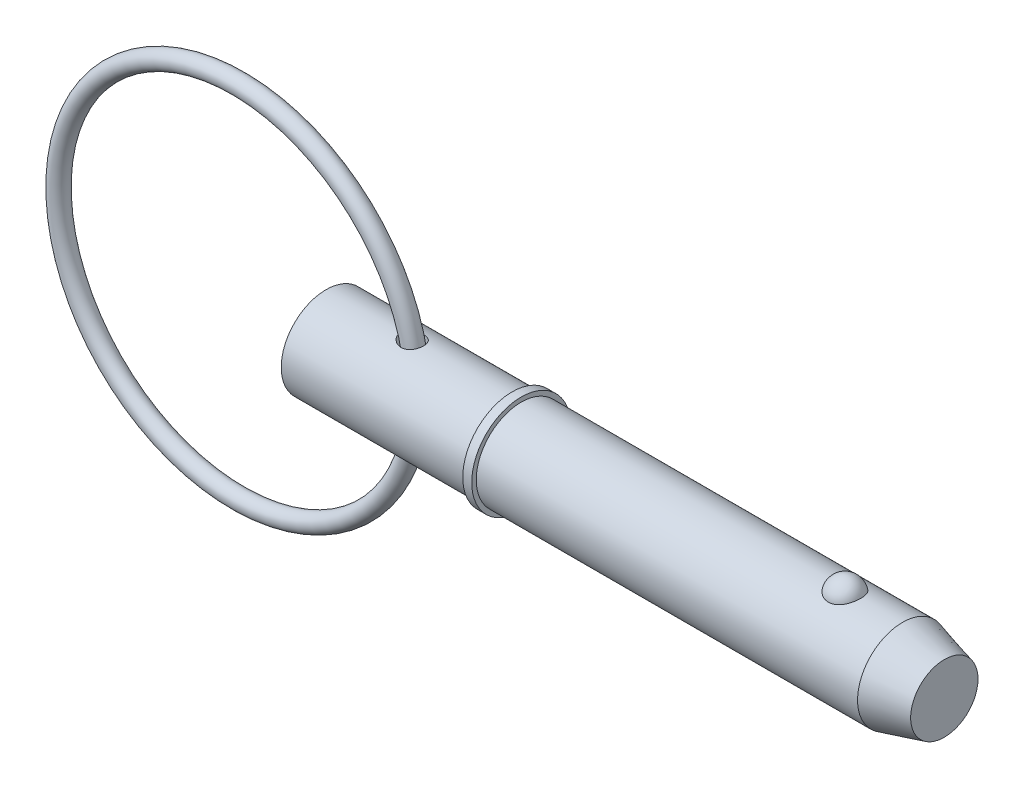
ISO-10303-21;
HEADER;
FILE_DESCRIPTION(('STEP AP214'),'2;1');
FILE_NAME('part.step','',(''),(''),'','','');
FILE_SCHEMA(('AUTOMOTIVE_DESIGN { 1 0 10303 214 1 1 1 1 }'));
ENDSEC;
DATA;
#1=APPLICATION_CONTEXT('core data for automotive mechanical design processes');
#2=APPLICATION_PROTOCOL_DEFINITION('international standard','automotive_design',2000,#1);
#3=PRODUCT_CONTEXT('',#1,'mechanical');
#4=PRODUCT('Part','Part','',(#3));
#5=PRODUCT_RELATED_PRODUCT_CATEGORY('part','',(#4));
#6=PRODUCT_DEFINITION_FORMATION('','',#4);
#7=PRODUCT_DEFINITION_CONTEXT('part definition',#1,'design');
#8=PRODUCT_DEFINITION('design','',#6,#7);
#9=PRODUCT_DEFINITION_SHAPE('','',#8);
#10=(LENGTH_UNIT() NAMED_UNIT(*) SI_UNIT(.MILLI.,.METRE.));
#11=(NAMED_UNIT(*) PLANE_ANGLE_UNIT() SI_UNIT($,.RADIAN.));
#12=(NAMED_UNIT(*) SI_UNIT($,.STERADIAN.) SOLID_ANGLE_UNIT());
#13=UNCERTAINTY_MEASURE_WITH_UNIT(LENGTH_MEASURE(1.E-05),#10,'distance_accuracy_value','');
#14=(GEOMETRIC_REPRESENTATION_CONTEXT(3) GLOBAL_UNCERTAINTY_ASSIGNED_CONTEXT((#13)) GLOBAL_UNIT_ASSIGNED_CONTEXT((#10,
#11,#12)) REPRESENTATION_CONTEXT('',''));
#15=CARTESIAN_POINT('',(0.,0.,0.));
#16=DIRECTION('',(0.,0.,1.));
#17=DIRECTION('',(1.,0.,0.));
#18=AXIS2_PLACEMENT_3D('',#15,#16,#17);
#19=CARTESIAN_POINT('',(-10.8860601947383,0.,0.));
#20=DIRECTION('',(0.,0.,1.));
#21=DIRECTION('',(1.,0.,0.));
#22=AXIS2_PLACEMENT_3D('',#19,#20,#21);
#23=TOROIDAL_SURFACE('',#22,22.225,1.111);
#24=CARTESIAN_POINT('',(12.4499398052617,0.,0.));
#25=VERTEX_POINT('',#24);
#26=VERTEX_LOOP('',#25);
#27=FACE_BOUND('',#26,.T.);
#28=ADVANCED_FACE('P0_F12',(#27),#23,.T.);
#29=CLOSED_SHELL('',(#28));
#30=MANIFOLD_SOLID_BREP('P0_B1',#29);
#31=CARTESIAN_POINT('',(0.,0.,0.));
#32=DIRECTION('',(1.,0.,0.));
#33=DIRECTION('',(0.,0.,-1.));
#34=AXIS2_PLACEMENT_3D('',#31,#32,#33);
#35=CYLINDRICAL_SURFACE('',#34,5.555);
#36=CARTESIAN_POINT('',(9.73108588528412,5.4531967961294,-1.05861687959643));
#37=CARTESIAN_POINT('',(9.79852417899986,5.4428857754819,-1.11173367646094));
#38=CARTESIAN_POINT('',(9.8705426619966,5.43287373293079,-1.15917228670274));
#39=CARTESIAN_POINT('',(10.0216706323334,5.41463354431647,-1.24159548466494));
#40=CARTESIAN_POINT('',(10.100788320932,5.40640749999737,-1.27656543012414));
#41=CARTESIAN_POINT('',(10.2640671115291,5.39277501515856,-1.33298568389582));
#42=CARTESIAN_POINT('',(10.3482338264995,5.38737178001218,-1.35442062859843));
#43=CARTESIAN_POINT('',(10.5191189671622,5.38018930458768,-1.38268153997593));
#44=CARTESIAN_POINT('',(10.6058357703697,5.37840780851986,-1.38951660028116));
#45=CARTESIAN_POINT('',(10.7759121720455,5.37883071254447,-1.38787777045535));
#46=CARTESIAN_POINT('',(10.8592768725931,5.38088957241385,-1.37996287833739));
#47=CARTESIAN_POINT('',(11.0231742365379,5.38856355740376,-1.34968531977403));
#48=CARTESIAN_POINT('',(11.1037078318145,5.39417750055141,-1.3273274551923));
#49=CARTESIAN_POINT('',(11.2542656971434,5.40784427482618,-1.27044672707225));
#50=CARTESIAN_POINT('',(11.3246325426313,5.41571997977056,-1.23678468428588));
#51=CARTESIAN_POINT('',(11.4584043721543,5.43310849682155,-1.15800564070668));
#52=CARTESIAN_POINT('',(11.5218100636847,5.4426211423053,-1.11288980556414));
#53=CARTESIAN_POINT('',(11.6387006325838,5.4619946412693,-1.01348173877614));
#54=CARTESIAN_POINT('',(11.6923567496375,5.47184490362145,-0.959388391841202));
#55=CARTESIAN_POINT('',(11.7899079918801,5.49098914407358,-0.842935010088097));
#56=CARTESIAN_POINT('',(11.8338027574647,5.50028310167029,-0.780574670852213));
#57=CARTESIAN_POINT('',(11.9111930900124,5.51740919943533,-0.64860577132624));
#58=CARTESIAN_POINT('',(11.944571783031,5.52522454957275,-0.578926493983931));
#59=CARTESIAN_POINT('',(11.9994972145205,5.53842713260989,-0.434834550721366));
#60=CARTESIAN_POINT('',(12.0210434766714,5.54381426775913,-0.360421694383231));
#61=CARTESIAN_POINT('',(12.0519313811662,5.55161917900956,-0.208311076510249));
#62=CARTESIAN_POINT('',(12.0611710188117,5.55401212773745,-0.130591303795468));
#63=CARTESIAN_POINT('',(12.0668974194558,5.55548938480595,0.0253480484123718));
#64=CARTESIAN_POINT('',(12.0633840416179,5.55457365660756,0.10356763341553));
#65=CARTESIAN_POINT('',(12.0436796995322,5.54953010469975,0.258343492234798));
#66=CARTESIAN_POINT('',(12.0274798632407,5.54540003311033,0.334898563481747));
#67=CARTESIAN_POINT('',(11.9827711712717,5.53437033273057,0.48411831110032));
#68=CARTESIAN_POINT('',(11.9542620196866,5.52747063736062,0.556782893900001));
#69=CARTESIAN_POINT('',(11.8856108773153,5.51165296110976,0.696153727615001));
#70=CARTESIAN_POINT('',(11.8454690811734,5.50273501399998,0.762860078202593));
#71=CARTESIAN_POINT('',(11.7545317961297,5.48386724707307,0.888403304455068));
#72=CARTESIAN_POINT('',(11.7037367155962,5.47391746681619,0.947240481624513));
#73=CARTESIAN_POINT('',(11.5931044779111,5.45416351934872,1.05504470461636));
#74=CARTESIAN_POINT('',(11.533318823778,5.44435885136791,1.10406448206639));
#75=CARTESIAN_POINT('',(11.4061321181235,5.42595363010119,1.19123649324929));
#76=CARTESIAN_POINT('',(11.3387321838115,5.41735290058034,1.22939031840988));
#77=CARTESIAN_POINT('',(11.1991395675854,5.4024225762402,1.29341737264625));
#78=CARTESIAN_POINT('',(11.1270175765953,5.39606585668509,1.3194385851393));
#79=CARTESIAN_POINT('',(10.979323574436,5.38614405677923,1.35937634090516));
#80=CARTESIAN_POINT('',(10.9037515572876,5.38257898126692,1.37329286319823));
#81=CARTESIAN_POINT('',(10.7507722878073,5.37854282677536,1.38901730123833));
#82=CARTESIAN_POINT('',(10.6733560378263,5.37809300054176,1.39074204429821));
#83=CARTESIAN_POINT('',(10.5192388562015,5.38029043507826,1.38221411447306));
#84=CARTESIAN_POINT('',(10.4425381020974,5.38293844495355,1.37195854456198));
#85=CARTESIAN_POINT('',(10.2878936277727,5.39116673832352,1.33926960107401));
#86=CARTESIAN_POINT('',(10.2100819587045,5.3968880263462,1.31624874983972));
#87=CARTESIAN_POINT('',(10.0591420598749,5.41064666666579,1.25849276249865));
#88=CARTESIAN_POINT('',(9.98601576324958,5.41868496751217,1.22375282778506));
#89=CARTESIAN_POINT('',(9.84175565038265,5.43675805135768,1.14087469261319));
#90=CARTESIAN_POINT('',(9.77103801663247,5.44688674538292,1.09202994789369));
#91=CARTESIAN_POINT('',(9.6388828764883,5.46759592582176,0.983100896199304));
#92=CARTESIAN_POINT('',(9.57744762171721,5.47817652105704,0.92301387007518));
#93=CARTESIAN_POINT('',(9.46620446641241,5.49850106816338,0.79298413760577));
#94=CARTESIAN_POINT('',(9.4163677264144,5.5082470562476,0.723066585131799));
#95=CARTESIAN_POINT('',(9.33050546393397,5.52566389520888,0.57497392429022));
#96=CARTESIAN_POINT('',(9.2944672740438,5.53333664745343,0.49680647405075));
#97=CARTESIAN_POINT('',(9.2410988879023,5.54491199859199,0.342579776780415));
#98=CARTESIAN_POINT('',(9.22228936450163,5.54910883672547,0.267055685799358));
#99=CARTESIAN_POINT('',(9.19883437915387,5.55436306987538,0.113748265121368));
#100=CARTESIAN_POINT('',(9.19417820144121,5.55542284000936,0.0359666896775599));
#101=CARTESIAN_POINT('',(9.19905385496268,5.55432298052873,-0.111477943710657));
#102=CARTESIAN_POINT('',(9.20724428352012,5.55246769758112,-0.181191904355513));
#103=CARTESIAN_POINT('',(9.23493000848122,5.54630180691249,-0.318223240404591));
#104=CARTESIAN_POINT('',(9.25442702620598,5.54199082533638,-0.385540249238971));
#105=CARTESIAN_POINT('',(9.30387481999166,5.5313474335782,-0.516280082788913));
#106=CARTESIAN_POINT('',(9.33386163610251,5.52500806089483,-0.579688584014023));
#107=CARTESIAN_POINT('',(9.40305503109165,5.51092599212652,-0.701037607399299));
#108=CARTESIAN_POINT('',(9.44225922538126,5.50318365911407,-0.758979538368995));
#109=CARTESIAN_POINT('',(9.52133732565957,5.48833949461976,-0.859230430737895));
#110=CARTESIAN_POINT('',(9.55998996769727,5.48134889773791,-0.90252975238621));
#111=CARTESIAN_POINT('',(9.64209346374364,5.46725903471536,-0.984288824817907));
#112=CARTESIAN_POINT('',(9.68554534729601,5.46015974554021,-1.02274753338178));
#113=CARTESIAN_POINT('',(9.73108588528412,5.4531967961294,-1.05861687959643));
#114=B_SPLINE_CURVE_WITH_KNOTS('',3,(#36,#37,#38,#39,#40,#41,#42,#43,#44,#45,#46,#47,#48,#49,
#50,#51,#52,#53,#54,#55,#56,#57,#58,#59,#60,#61,#62,#63,#64,#65,#66,#67,#68,#69,#70,#71,#72,#73,
#74,#75,#76,#77,#78,#79,#80,#81,#82,#83,#84,#85,#86,#87,#88,#89,#90,#91,#92,#93,#94,#95,#96,#97,
#98,#99,#100,#101,#102,#103,#104,#105,#106,#107,#108,#109,#110,#111,#112,#113),.UNSPECIFIED.,
.T.,.F.,(4,2,2,2,2,2,2,2,2,2,2,2,2,2,2,2,2,2,2,2,2,2,2,2,2,2,2,2,2,2,2,2,2,2,2,2,2,2,4),(0.,
0.259176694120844,0.518656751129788,0.778430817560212,1.03804303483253,1.28801585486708,
1.53790560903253,1.77195750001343,2.00598558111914,2.23539047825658,2.46480382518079,
2.69668356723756,2.9285726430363,3.16237203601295,3.39617401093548,3.63013963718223,
3.86411088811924,4.09807822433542,4.33203659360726,4.56470246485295,4.7973342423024,
5.02704913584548,5.25676442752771,5.48804534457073,5.71938220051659,5.96237360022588,
6.20546461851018,6.46387943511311,6.72235683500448,6.98018450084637,7.23777490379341,
7.47029684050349,7.70264268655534,7.91229396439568,8.12197716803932,8.33238797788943,
8.54274441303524,8.71772674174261,8.89274668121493),.UNSPECIFIED.);
#115=CARTESIAN_POINT('',(9.73108588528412,5.4531967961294,-1.05861687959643));
#116=VERTEX_POINT('',#115);
#117=EDGE_CURVE('P1_E42',#116,#116,#114,.T.);
#118=ORIENTED_EDGE('',*,*,#117,.T.);
#119=EDGE_LOOP('',(#118));
#120=FACE_BOUND('',#119,.T.);
#121=CARTESIAN_POINT('',(0.,0.,0.));
#122=DIRECTION('',(1.,0.,0.));
#123=DIRECTION('',(0.,0.,-1.));
#124=AXIS2_PLACEMENT_3D('',#121,#122,#123);
#125=CIRCLE('',#124,5.555);
#126=CARTESIAN_POINT('',(0.,0.,-5.555));
#127=VERTEX_POINT('',#126);
#128=EDGE_CURVE('P1_E9',#127,#127,#125,.T.);
#129=ORIENTED_EDGE('',*,*,#128,.T.);
#130=EDGE_LOOP('',(#129));
#131=FACE_BOUND('',#130,.T.);
#132=CARTESIAN_POINT('',(23.019,0.,0.));
#133=DIRECTION('',(1.,0.,0.));
#134=DIRECTION('',(0.,0.,-1.));
#135=AXIS2_PLACEMENT_3D('',#132,#133,#134);
#136=CIRCLE('',#135,5.555);
#137=CARTESIAN_POINT('',(23.019,0.,-5.555));
#138=VERTEX_POINT('',#137);
#139=EDGE_CURVE('P1_E25',#138,#138,#136,.T.);
#140=ORIENTED_EDGE('',*,*,#139,.F.);
#141=EDGE_LOOP('',(#140));
#142=FACE_BOUND('',#141,.T.);
#143=CARTESIAN_POINT('',(9.73108588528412,-5.4531967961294,-1.05861687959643));
#144=CARTESIAN_POINT('',(9.66821110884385,-5.46281068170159,-1.00909184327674));
#145=CARTESIAN_POINT('',(9.60927221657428,-5.47269103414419,-0.954597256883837));
#146=CARTESIAN_POINT('',(9.50103698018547,-5.49196271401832,-0.836622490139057));
#147=CARTESIAN_POINT('',(9.45174193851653,-5.50135397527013,-0.77314109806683));
#148=CARTESIAN_POINT('',(9.36449982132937,-5.51864538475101,-0.638139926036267));
#149=CARTESIAN_POINT('',(9.32660692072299,-5.52653835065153,-0.566583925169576));
#150=CARTESIAN_POINT('',(9.26443740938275,-5.53978685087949,-0.417563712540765));
#151=CARTESIAN_POINT('',(9.24015003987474,-5.54514438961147,-0.34010422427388));
#152=CARTESIAN_POINT('',(9.20806696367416,-5.55228040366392,-0.18838925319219));
#153=CARTESIAN_POINT('',(9.19907227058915,-5.55431849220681,-0.114399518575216));
#154=CARTESIAN_POINT('',(9.19432225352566,-5.55539069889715,0.0340148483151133));
#155=CARTESIAN_POINT('',(9.19856204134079,-5.55442592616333,0.108439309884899));
#156=CARTESIAN_POINT('',(9.21926816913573,-5.54978420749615,0.250226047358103));
#157=CARTESIAN_POINT('',(9.2348766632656,-5.54629766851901,0.31772275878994));
#158=CARTESIAN_POINT('',(9.27656619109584,-5.53719805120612,0.449233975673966));
#159=CARTESIAN_POINT('',(9.3026486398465,-5.53158468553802,0.513248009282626));
#160=CARTESIAN_POINT('',(9.36540111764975,-5.51852259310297,0.63880901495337));
#161=CARTESIAN_POINT('',(9.40244578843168,-5.51101059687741,0.700161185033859));
#162=CARTESIAN_POINT('',(9.48531033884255,-5.49498546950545,0.816463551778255));
#163=CARTESIAN_POINT('',(9.5311337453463,-5.48647193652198,0.871411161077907));
#164=CARTESIAN_POINT('',(9.63549825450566,-5.46826315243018,0.979510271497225));
#165=CARTESIAN_POINT('',(9.69487291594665,-5.4585383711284,1.03185240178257));
#166=CARTESIAN_POINT('',(9.82107706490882,-5.43973797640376,1.12677509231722));
#167=CARTESIAN_POINT('',(9.8879103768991,-5.43066269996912,1.16935061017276));
#168=CARTESIAN_POINT('',(10.033391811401,-5.41336505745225,1.24708757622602));
#169=CARTESIAN_POINT('',(10.1125613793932,-5.40528106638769,1.28130933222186));
#170=CARTESIAN_POINT('',(10.2757060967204,-5.39196874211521,1.3362270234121));
#171=CARTESIAN_POINT('',(10.3596813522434,-5.38674047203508,1.35692265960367));
#172=CARTESIAN_POINT('',(10.5297702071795,-5.37991196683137,1.38375156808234));
#173=CARTESIAN_POINT('',(10.6158742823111,-5.37829778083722,1.38994084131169));
#174=CARTESIAN_POINT('',(10.7878226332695,-5.3790107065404,1.38718250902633));
#175=CARTESIAN_POINT('',(10.8736670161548,-5.38133587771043,1.37824235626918));
#176=CARTESIAN_POINT('',(11.0366214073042,-5.38945418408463,1.34612618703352));
#177=CARTESIAN_POINT('',(11.1139351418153,-5.39501006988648,1.32392147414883));
#178=CARTESIAN_POINT('',(11.2633246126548,-5.40877222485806,1.26652021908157));
#179=CARTESIAN_POINT('',(11.3354015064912,-5.4169779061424,1.23132655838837));
#180=CARTESIAN_POINT('',(11.4690899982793,-5.43466078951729,1.15069817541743));
#181=CARTESIAN_POINT('',(11.5310200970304,-5.4440673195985,1.10577441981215));
#182=CARTESIAN_POINT('',(11.6463540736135,-5.46335537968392,1.0061512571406));
#183=CARTESIAN_POINT('',(11.6997580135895,-5.47323690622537,0.951451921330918));
#184=CARTESIAN_POINT('',(11.7967319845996,-5.49239864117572,0.833747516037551));
#185=CARTESIAN_POINT('',(11.8402908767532,-5.50167816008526,0.770733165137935));
#186=CARTESIAN_POINT('',(11.9164538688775,-5.518621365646,0.638202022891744));
#187=CARTESIAN_POINT('',(11.9490573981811,-5.52628496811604,0.568684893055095));
#188=CARTESIAN_POINT('',(12.0028717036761,-5.53925911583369,0.424207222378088));
#189=CARTESIAN_POINT('',(12.023941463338,-5.54454040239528,0.349191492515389));
#190=CARTESIAN_POINT('',(12.053591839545,-5.55204602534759,0.196582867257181));
#191=CARTESIAN_POINT('',(12.0621722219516,-5.55427030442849,0.118989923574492));
#192=CARTESIAN_POINT('',(12.0666512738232,-5.55542602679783,-0.0368468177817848));
#193=CARTESIAN_POINT('',(12.0625074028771,-5.55434642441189,-0.115091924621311));
#194=CARTESIAN_POINT('',(12.0415418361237,-5.54898613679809,-0.269753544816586));
#195=CARTESIAN_POINT('',(12.0247199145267,-5.54470539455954,-0.346170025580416));
#196=CARTESIAN_POINT('',(11.9787920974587,-5.53340452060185,-0.495008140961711));
#197=CARTESIAN_POINT('',(11.9496857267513,-5.52638428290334,-0.56742962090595));
#198=CARTESIAN_POINT('',(11.8798787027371,-5.51036911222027,-0.706216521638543));
#199=CARTESIAN_POINT('',(11.8391779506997,-5.50137416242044,-0.772581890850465));
#200=CARTESIAN_POINT('',(11.7472553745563,-5.48242167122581,-0.89724716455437));
#201=CARTESIAN_POINT('',(11.6960515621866,-5.47246579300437,-0.955560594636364));
#202=CARTESIAN_POINT('',(11.5843994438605,-5.45270071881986,-1.06256643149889));
#203=CARTESIAN_POINT('',(11.5239521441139,-5.44289150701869,-1.11125988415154));
#204=CARTESIAN_POINT('',(11.396157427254,-5.42463941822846,-1.19717500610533));
#205=CARTESIAN_POINT('',(11.3288903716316,-5.41618309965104,-1.23451335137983));
#206=CARTESIAN_POINT('',(11.1888557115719,-5.40145691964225,-1.29743539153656));
#207=CARTESIAN_POINT('',(11.1160887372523,-5.39518680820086,-1.32302043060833));
#208=CARTESIAN_POINT('',(10.9677009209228,-5.38553131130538,-1.36179181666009));
#209=CARTESIAN_POINT('',(10.8921036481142,-5.3821260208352,-1.3750637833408));
#210=CARTESIAN_POINT('',(10.7396925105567,-5.37842027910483,-1.38948741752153));
#211=CARTESIAN_POINT('',(10.6628784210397,-5.37812040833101,-1.39063681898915));
#212=CARTESIAN_POINT('',(10.5077947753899,-5.38059635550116,-1.38102577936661));
#213=CARTESIAN_POINT('',(10.4295489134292,-5.3834629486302,-1.36991384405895));
#214=CARTESIAN_POINT('',(10.2758428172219,-5.3920092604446,-1.33587599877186));
#215=CARTESIAN_POINT('',(10.2003829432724,-5.39768934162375,-1.3129485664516));
#216=CARTESIAN_POINT('',(10.0559381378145,-5.41102817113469,-1.25682313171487));
#217=CARTESIAN_POINT('',(9.98683368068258,-5.41862962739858,-1.22391777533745));
#218=CARTESIAN_POINT('',(9.85432617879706,-5.43513913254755,-1.14838146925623));
#219=CARTESIAN_POINT('',(9.79092361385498,-5.44404729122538,-1.1057497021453));
#220=CARTESIAN_POINT('',(9.73108588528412,-5.4531967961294,-1.05861687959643));
#221=B_SPLINE_CURVE_WITH_KNOTS('',3,(#143,#144,#145,#146,#147,#148,#149,#150,#151,#152,#153,
#154,#155,#156,#157,#158,#159,#160,#161,#162,#163,#164,#165,#166,#167,#168,#169,#170,#171,#172,
#173,#174,#175,#176,#177,#178,#179,#180,#181,#182,#183,#184,#185,#186,#187,#188,#189,#190,#191,
#192,#193,#194,#195,#196,#197,#198,#199,#200,#201,#202,#203,#204,#205,#206,#207,#208,#209,#210,
#211,#212,#213,#214,#215,#216,#217,#218,#219,#220),.UNSPECIFIED.,.T.,.F.,(4,2,2,2,2,2,2,2,2,2,2,
2,2,2,2,2,2,2,2,2,2,2,2,2,2,2,2,2,2,2,2,2,2,2,2,2,2,2,4),(0.,0.241596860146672,
0.483226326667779,0.725986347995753,0.968554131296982,1.19103755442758,1.41343881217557,
1.62059806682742,1.82778531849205,2.04308674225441,2.25847484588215,2.4967195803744,
2.73508704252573,2.99374644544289,3.25241156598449,3.51007646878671,3.76761448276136,
4.00827541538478,4.24888299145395,4.47904430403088,4.70920393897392,4.93962269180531,
5.17005344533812,5.4032419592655,5.63643484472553,5.87040820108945,6.10438572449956,
6.33837230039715,6.57236086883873,6.80595147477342,7.03951667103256,7.27059385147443,
7.50164459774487,7.73107640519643,7.96055109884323,8.19677907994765,8.43303750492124,
8.66294515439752,8.8928721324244),.UNSPECIFIED.);
#222=CARTESIAN_POINT('',(9.73108588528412,-5.4531967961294,-1.05861687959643));
#223=VERTEX_POINT('',#222);
#224=EDGE_CURVE('P1_E17',#223,#223,#221,.T.);
#225=ORIENTED_EDGE('',*,*,#224,.T.);
#226=EDGE_LOOP('',(#225));
#227=FACE_BOUND('',#226,.T.);
#228=ADVANCED_FACE('P1_F13',(#120,#131,#142,#227),#35,.T.);
#229=CARTESIAN_POINT('',(0.,0.,0.));
#230=DIRECTION('',(1.,0.,0.));
#231=DIRECTION('',(0.,0.,-1.));
#232=AXIS2_PLACEMENT_3D('',#229,#230,#231);
#233=CYLINDRICAL_SURFACE('',#232,5.555);
#234=CARTESIAN_POINT('',(71.3171144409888,0.,0.));
#235=DIRECTION('',(1.,0.,0.));
#236=DIRECTION('',(0.,0.,-1.));
#237=AXIS2_PLACEMENT_3D('',#234,#235,#236);
#238=CIRCLE('',#237,5.555);
#239=CARTESIAN_POINT('',(71.3171144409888,0.,-5.555));
#240=VERTEX_POINT('',#239);
#241=EDGE_CURVE('P1_E99',#240,#240,#238,.T.);
#242=ORIENTED_EDGE('',*,*,#241,.F.);
#243=EDGE_LOOP('',(#242));
#244=FACE_BOUND('',#243,.T.);
#245=CARTESIAN_POINT('',(24.13,0.,0.));
#246=DIRECTION('',(1.,0.,0.));
#247=DIRECTION('',(0.,0.,-1.));
#248=AXIS2_PLACEMENT_3D('',#245,#246,#247);
#249=CIRCLE('',#248,5.555);
#250=CARTESIAN_POINT('',(24.13,0.,-5.555));
#251=VERTEX_POINT('',#250);
#252=EDGE_CURVE('P1_E96',#251,#251,#249,.T.);
#253=ORIENTED_EDGE('',*,*,#252,.T.);
#254=EDGE_LOOP('',(#253));
#255=FACE_BOUND('',#254,.T.);
#256=CARTESIAN_POINT('',(64.1986264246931,5.16741224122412,2.03859650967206));
#257=CARTESIAN_POINT('',(64.0929492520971,5.16740893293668,2.03859990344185));
#258=CARTESIAN_POINT('',(63.9872989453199,5.17079470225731,2.03008306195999));
#259=CARTESIAN_POINT('',(63.7791419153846,5.18392795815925,1.99630721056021));
#260=CARTESIAN_POINT('',(63.6766344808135,5.19367399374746,1.97105201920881));
#261=CARTESIAN_POINT('',(63.4777710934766,5.21839168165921,1.90463997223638));
#262=CARTESIAN_POINT('',(63.3814064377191,5.23335573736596,1.86350622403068));
#263=CARTESIAN_POINT('',(63.1970804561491,5.26688076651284,1.76652592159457));
#264=CARTESIAN_POINT('',(63.1091207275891,5.28544242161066,1.71067657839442));
#265=CARTESIAN_POINT('',(62.941265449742,5.32479845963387,1.58399959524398));
#266=CARTESIAN_POINT('',(62.8616656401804,5.34564089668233,1.5127954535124));
#267=CARTESIAN_POINT('',(62.7151290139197,5.38697258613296,1.3582858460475));
#268=CARTESIAN_POINT('',(62.648194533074,5.40746177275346,1.27497815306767));
#269=CARTESIAN_POINT('',(62.5256103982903,5.44694508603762,1.09440293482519));
#270=CARTESIAN_POINT('',(62.4705989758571,5.46583143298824,0.996677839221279));
#271=CARTESIAN_POINT('',(62.3769376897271,5.49908030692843,0.792961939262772));
#272=CARTESIAN_POINT('',(62.3382894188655,5.513442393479,0.686970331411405));
#273=CARTESIAN_POINT('',(62.2776807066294,5.53635851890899,0.468019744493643));
#274=CARTESIAN_POINT('',(62.2559725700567,5.54482455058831,0.354981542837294));
#275=CARTESIAN_POINT('',(62.2306362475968,5.55473324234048,0.126595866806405));
#276=CARTESIAN_POINT('',(62.2270077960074,5.55617600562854,0.0112484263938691));
#277=CARTESIAN_POINT('',(62.2378817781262,5.55189984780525,-0.218011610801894));
#278=CARTESIAN_POINT('',(62.2523151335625,5.54620821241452,-0.331928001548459));
#279=CARTESIAN_POINT('',(62.298903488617,5.52828920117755,-0.555544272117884));
#280=CARTESIAN_POINT('',(62.3310588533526,5.51606169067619,-0.665244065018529));
#281=CARTESIAN_POINT('',(62.4124883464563,5.48630779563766,-0.877469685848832));
#282=CARTESIAN_POINT('',(62.4617816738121,5.4687754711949,-0.979987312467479));
#283=CARTESIAN_POINT('',(62.5764785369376,5.43024700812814,-1.1748697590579));
#284=CARTESIAN_POINT('',(62.6418831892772,5.4092506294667,-1.26723387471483));
#285=CARTESIAN_POINT('',(62.7875712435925,5.36600927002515,-1.43940133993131));
#286=CARTESIAN_POINT('',(62.8678859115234,5.34376173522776,-1.51917763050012));
#287=CARTESIAN_POINT('',(63.0414520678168,5.30057971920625,-1.66360338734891));
#288=CARTESIAN_POINT('',(63.134702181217,5.27964509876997,-1.72825445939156));
#289=CARTESIAN_POINT('',(63.3293939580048,5.24205250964,-1.83909478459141));
#290=CARTESIAN_POINT('',(63.4305900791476,5.22530519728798,-1.88568407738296));
#291=CARTESIAN_POINT('',(63.6401552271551,5.19750919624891,-1.96100802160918));
#292=CARTESIAN_POINT('',(63.7485215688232,5.1864583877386,-1.98974931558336));
#293=CARTESIAN_POINT('',(63.9634989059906,5.17184410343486,-2.02742262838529));
#294=CARTESIAN_POINT('',(64.069925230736,5.1679328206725,-2.03727608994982));
#295=CARTESIAN_POINT('',(64.2829925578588,5.16698995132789,-2.03966777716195));
#296=CARTESIAN_POINT('',(64.3896335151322,5.16995704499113,-2.03220932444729));
#297=CARTESIAN_POINT('',(64.5967730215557,5.18222383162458,-2.00071170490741));
#298=CARTESIAN_POINT('',(64.6973599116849,5.19133213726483,-1.97717337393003));
#299=CARTESIAN_POINT('',(64.8930141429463,5.21467637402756,-1.91475248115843));
#300=CARTESIAN_POINT('',(64.9880810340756,5.22891272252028,-1.8758686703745));
#301=CARTESIAN_POINT('',(65.172371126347,5.26137066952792,-1.78282713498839));
#302=CARTESIAN_POINT('',(65.2614190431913,5.27967329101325,-1.72835124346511));
#303=CARTESIAN_POINT('',(65.4292880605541,5.3181741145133,-1.60597483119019));
#304=CARTESIAN_POINT('',(65.5081068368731,5.33837274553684,-1.53807126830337));
#305=CARTESIAN_POINT('',(65.6575156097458,5.37968287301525,-1.38688970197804));
#306=CARTESIAN_POINT('',(65.7275058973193,5.40079011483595,-1.30301744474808));
#307=CARTESIAN_POINT('',(65.8530125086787,5.44074401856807,-1.12458170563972));
#308=CARTESIAN_POINT('',(65.9085262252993,5.4595902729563,-1.03001630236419));
#309=CARTESIAN_POINT('',(66.0055507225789,5.49369849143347,-0.82943923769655));
#310=CARTESIAN_POINT('',(66.0465483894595,5.50882422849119,-0.723155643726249));
#311=CARTESIAN_POINT('',(66.1111250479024,5.53310911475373,-0.504772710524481));
#312=CARTESIAN_POINT('',(66.1347036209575,5.54226812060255,-0.392673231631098));
#313=CARTESIAN_POINT('',(66.164013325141,5.55370358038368,-0.16545946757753));
#314=CARTESIAN_POINT('',(66.1696884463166,5.55595843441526,-0.050336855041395));
#315=CARTESIAN_POINT('',(66.162916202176,5.55329317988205,0.179288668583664));
#316=CARTESIAN_POINT('',(66.1504690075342,5.54837313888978,0.293791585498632));
#317=CARTESIAN_POINT('',(66.1077798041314,5.53189037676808,0.518526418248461));
#318=CARTESIAN_POINT('',(66.077598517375,5.5203503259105,0.628771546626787));
#319=CARTESIAN_POINT('',(66.0000962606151,5.49182453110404,0.842318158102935));
#320=CARTESIAN_POINT('',(65.9527743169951,5.47483847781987,0.945619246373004));
#321=CARTESIAN_POINT('',(65.8417204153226,5.43710633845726,1.14281571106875));
#322=CARTESIAN_POINT('',(65.7779215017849,5.41634501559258,1.23667048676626));
#323=CARTESIAN_POINT('',(65.6353577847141,5.37334572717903,1.41185243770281));
#324=CARTESIAN_POINT('',(65.5565932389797,5.35110778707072,1.4931798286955));
#325=CARTESIAN_POINT('',(65.3864234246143,5.30779474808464,1.64049162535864));
#326=CARTESIAN_POINT('',(65.2951002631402,5.28671324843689,1.7065687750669));
#327=CARTESIAN_POINT('',(65.1017390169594,5.24804852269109,1.82201372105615));
#328=CARTESIAN_POINT('',(64.9997005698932,5.23046541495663,1.87138095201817));
#329=CARTESIAN_POINT('',(64.7836187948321,5.20042692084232,1.95335298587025));
#330=CARTESIAN_POINT('',(64.669260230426,5.18820192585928,1.98521734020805));
#331=CARTESIAN_POINT('',(64.4361307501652,5.17169804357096,2.02783294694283));
#332=CARTESIAN_POINT('',(64.3173616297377,5.16741595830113,2.03859269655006));
#333=CARTESIAN_POINT('',(64.1986264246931,5.16741224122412,2.03859650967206));
#334=B_SPLINE_CURVE_WITH_KNOTS('',3,(#256,#257,#258,#259,#260,#261,#262,#263,#264,#265,#266,
#267,#268,#269,#270,#271,#272,#273,#274,#275,#276,#277,#278,#279,#280,#281,#282,#283,#284,#285,
#286,#287,#288,#289,#290,#291,#292,#293,#294,#295,#296,#297,#298,#299,#300,#301,#302,#303,#304,
#305,#306,#307,#308,#309,#310,#311,#312,#313,#314,#315,#316,#317,#318,#319,#320,#321,#322,#323,
#324,#325,#326,#327,#328,#329,#330,#331,#332,#333),.UNSPECIFIED.,.T.,.F.,(4,2,2,2,2,2,2,2,2,2,2,
2,2,2,2,2,2,2,2,2,2,2,2,2,2,2,2,2,2,2,2,2,2,2,2,2,2,2,4),(0.,0.316595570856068,
0.633118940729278,0.949183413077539,1.26530783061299,1.59030762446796,1.91536729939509,
2.25495824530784,2.59458224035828,2.93917283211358,3.28375835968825,3.62703002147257,
3.97030875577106,4.31397329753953,4.657661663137,5.00207904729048,5.34645984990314,
5.68270547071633,6.01882587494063,6.33808403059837,6.65728093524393,6.96696376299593,
7.27667180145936,7.59321535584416,7.90983070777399,8.24210387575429,8.5744368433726,
8.9175589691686,9.26068933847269,9.60489211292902,9.94909164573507,10.2921194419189,
10.6351667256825,10.9796305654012,11.3240884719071,11.6663928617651,12.0087088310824,
12.3645679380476,12.7202837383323),.UNSPECIFIED.);
#335=CARTESIAN_POINT('',(64.1986264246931,5.16741224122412,2.03859650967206));
#336=VERTEX_POINT('',#335);
#337=EDGE_CURVE('P1_E34',#336,#336,#334,.T.);
#338=ORIENTED_EDGE('',*,*,#337,.T.);
#339=EDGE_LOOP('',(#338));
#340=FACE_BOUND('',#339,.T.);
#341=ADVANCED_FACE('P1_F46',(#244,#255,#340),#233,.T.);
#342=CARTESIAN_POINT('',(0.,0.,0.));
#343=DIRECTION('',(-1.,0.,0.));
#344=DIRECTION('',(0.,0.,1.));
#345=AXIS2_PLACEMENT_3D('',#342,#343,#344);
#346=PLANE('',#345);
#347=ORIENTED_EDGE('',*,*,#128,.F.);
#348=EDGE_LOOP('',(#347));
#349=FACE_BOUND('',#348,.T.);
#350=ADVANCED_FACE('P1_F15',(#349),#346,.T.);
#351=CARTESIAN_POINT('',(23.019,5.555,0.));
#352=DIRECTION('',(-1.,0.,0.));
#353=DIRECTION('',(0.,0.,1.));
#354=AXIS2_PLACEMENT_3D('',#351,#352,#353);
#355=PLANE('',#354);
#356=ORIENTED_EDGE('',*,*,#139,.T.);
#357=EDGE_LOOP('',(#356));
#358=FACE_BOUND('',#357,.T.);
#359=CARTESIAN_POINT('',(23.019,0.,0.));
#360=DIRECTION('',(1.,0.,0.));
#361=DIRECTION('',(0.,0.,-1.));
#362=AXIS2_PLACEMENT_3D('',#359,#360,#361);
#363=CIRCLE('',#362,6.1105);
#364=CARTESIAN_POINT('',(23.019,0.,-6.1105));
#365=VERTEX_POINT('',#364);
#366=EDGE_CURVE('P1_E30',#365,#365,#363,.T.);
#367=ORIENTED_EDGE('',*,*,#366,.F.);
#368=EDGE_LOOP('',(#367));
#369=FACE_BOUND('',#368,.T.);
#370=ADVANCED_FACE('P1_F81',(#358,#369),#355,.T.);
#371=CARTESIAN_POINT('',(0.,0.,0.));
#372=DIRECTION('',(1.,0.,0.));
#373=DIRECTION('',(0.,0.,-1.));
#374=AXIS2_PLACEMENT_3D('',#371,#372,#373);
#375=CYLINDRICAL_SURFACE('',#374,6.1105);
#376=ORIENTED_EDGE('',*,*,#366,.T.);
#377=EDGE_LOOP('',(#376));
#378=FACE_BOUND('',#377,.T.);
#379=CARTESIAN_POINT('',(24.13,0.,0.));
#380=DIRECTION('',(1.,0.,0.));
#381=DIRECTION('',(0.,0.,-1.));
#382=AXIS2_PLACEMENT_3D('',#379,#380,#381);
#383=CIRCLE('',#382,6.1105);
#384=CARTESIAN_POINT('',(24.13,0.,-6.1105));
#385=VERTEX_POINT('',#384);
#386=EDGE_CURVE('P1_E95',#385,#385,#383,.T.);
#387=ORIENTED_EDGE('',*,*,#386,.F.);
#388=EDGE_LOOP('',(#387));
#389=FACE_BOUND('',#388,.T.);
#390=ADVANCED_FACE('P1_F68',(#378,#389),#375,.T.);
#391=CARTESIAN_POINT('',(24.13,6.1105,0.));
#392=DIRECTION('',(1.,0.,0.));
#393=DIRECTION('',(0.,0.,-1.));
#394=AXIS2_PLACEMENT_3D('',#391,#392,#393);
#395=PLANE('',#394);
#396=ORIENTED_EDGE('',*,*,#386,.T.);
#397=EDGE_LOOP('',(#396));
#398=FACE_BOUND('',#397,.T.);
#399=ORIENTED_EDGE('',*,*,#252,.F.);
#400=EDGE_LOOP('',(#399));
#401=FACE_BOUND('',#400,.T.);
#402=ADVANCED_FACE('P1_F62',(#398,#401),#395,.T.);
#403=CARTESIAN_POINT('',(76.5,0.,0.));
#404=DIRECTION('',(-1.,0.,0.));
#405=DIRECTION('',(0.,0.,1.));
#406=AXIS2_PLACEMENT_3D('',#403,#404,#405);
#407=CONICAL_SURFACE('',#406,4.16625000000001,0.26179938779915);
#408=ORIENTED_EDGE('',*,*,#241,.T.);
#409=EDGE_LOOP('',(#408));
#410=FACE_BOUND('',#409,.T.);
#411=CARTESIAN_POINT('',(76.5,0.,0.));
#412=DIRECTION('',(1.,0.,0.));
#413=DIRECTION('',(0.,0.,-1.));
#414=AXIS2_PLACEMENT_3D('',#411,#412,#413);
#415=CIRCLE('',#414,4.16625000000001);
#416=CARTESIAN_POINT('',(76.5,0.,-4.16625000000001));
#417=VERTEX_POINT('',#416);
#418=EDGE_CURVE('P1_E41',#417,#417,#415,.T.);
#419=ORIENTED_EDGE('',*,*,#418,.F.);
#420=EDGE_LOOP('',(#419));
#421=FACE_BOUND('',#420,.T.);
#422=ADVANCED_FACE('P1_F59',(#410,#421),#407,.T.);
#423=CARTESIAN_POINT('',(76.5,4.16625000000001,0.));
#424=DIRECTION('',(1.,0.,0.));
#425=DIRECTION('',(0.,0.,-1.));
#426=AXIS2_PLACEMENT_3D('',#423,#424,#425);
#427=PLANE('',#426);
#428=ORIENTED_EDGE('',*,*,#418,.T.);
#429=EDGE_LOOP('',(#428));
#430=FACE_BOUND('',#429,.T.);
#431=ADVANCED_FACE('P1_F55',(#430),#427,.T.);
#432=CARTESIAN_POINT('',(64.1986264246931,4.9995,0.));
#433=DIRECTION('',(-1.,0.,0.));
#434=DIRECTION('',(0.,1.,0.));
#435=AXIS2_PLACEMENT_3D('',#432,#433,#434);
#436=SPHERICAL_SURFACE('',#435,2.0455);
#437=ORIENTED_EDGE('',*,*,#337,.F.);
#438=EDGE_LOOP('',(#437));
#439=FACE_BOUND('',#438,.T.);
#440=ADVANCED_FACE('P1_F50',(#439),#436,.T.);
#441=CARTESIAN_POINT('',(-10.8860601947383,0.,0.));
#442=DIRECTION('',(0.,0.,1.));
#443=DIRECTION('',(1.,0.,0.));
#444=AXIS2_PLACEMENT_3D('',#441,#442,#443);
#445=TOROIDAL_SURFACE('',#444,22.225,1.38875);
#446=ORIENTED_EDGE('',*,*,#224,.F.);
#447=EDGE_LOOP('',(#446));
#448=FACE_BOUND('',#447,.T.);
#449=ORIENTED_EDGE('',*,*,#117,.F.);
#450=EDGE_LOOP('',(#449));
#451=FACE_BOUND('',#450,.T.);
#452=ADVANCED_FACE('P1_F54',(#448,#451),#445,.F.);
#453=CLOSED_SHELL('',(#228,#341,#350,#370,#390,#402,#422,#431,#440,#452));
#454=MANIFOLD_SOLID_BREP('P1_B1',#453);
#455=ADVANCED_BREP_SHAPE_REPRESENTATION('',(#18,#30,#454),#14);
#456=SHAPE_DEFINITION_REPRESENTATION(#9,#455);
ENDSEC;
END-ISO-10303-21;
